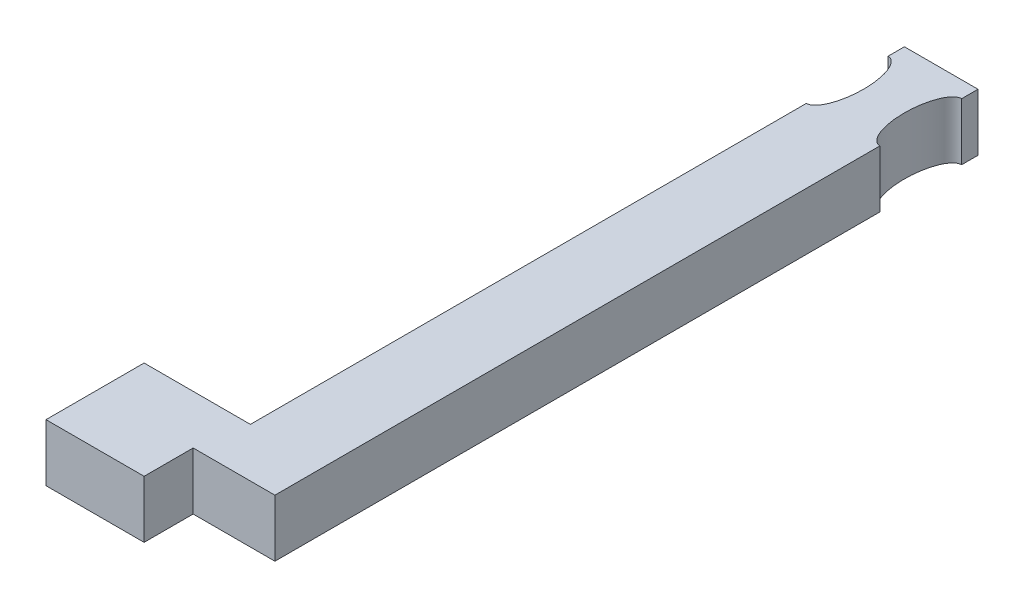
ISO-10303-21;
HEADER;
FILE_DESCRIPTION(('STEP AP214'),'2;1');
FILE_NAME('part.step','',(''),(''),'','','');
FILE_SCHEMA(('AUTOMOTIVE_DESIGN { 1 0 10303 214 1 1 1 1 }'));
ENDSEC;
DATA;
#1=APPLICATION_CONTEXT('core data for automotive mechanical design processes');
#2=APPLICATION_PROTOCOL_DEFINITION('international standard','automotive_design',2000,#1);
#3=PRODUCT_CONTEXT('',#1,'mechanical');
#4=PRODUCT('Part','Part','',(#3));
#5=PRODUCT_RELATED_PRODUCT_CATEGORY('part','',(#4));
#6=PRODUCT_DEFINITION_FORMATION('','',#4);
#7=PRODUCT_DEFINITION_CONTEXT('part definition',#1,'design');
#8=PRODUCT_DEFINITION('design','',#6,#7);
#9=PRODUCT_DEFINITION_SHAPE('','',#8);
#10=(LENGTH_UNIT() NAMED_UNIT(*) SI_UNIT(.MILLI.,.METRE.));
#11=(NAMED_UNIT(*) PLANE_ANGLE_UNIT() SI_UNIT($,.RADIAN.));
#12=(NAMED_UNIT(*) SI_UNIT($,.STERADIAN.) SOLID_ANGLE_UNIT());
#13=UNCERTAINTY_MEASURE_WITH_UNIT(LENGTH_MEASURE(1.E-05),#10,'distance_accuracy_value','');
#14=(GEOMETRIC_REPRESENTATION_CONTEXT(3) GLOBAL_UNCERTAINTY_ASSIGNED_CONTEXT((#13)) GLOBAL_UNIT_ASSIGNED_CONTEXT((#10,
#11,#12)) REPRESENTATION_CONTEXT('',''));
#15=CARTESIAN_POINT('',(0.,0.,0.));
#16=DIRECTION('',(0.,0.,1.));
#17=DIRECTION('',(1.,0.,0.));
#18=AXIS2_PLACEMENT_3D('',#15,#16,#17);
#19=CARTESIAN_POINT('',(6.5,3.5,-46.));
#20=DIRECTION('',(1.,0.,0.));
#21=DIRECTION('',(0.,0.,-1.));
#22=AXIS2_PLACEMENT_3D('',#19,#20,#21);
#23=PLANE('',#22);
#24=DIRECTION('',(0.,0.,1.));
#25=VECTOR('',#24,1.);
#26=CARTESIAN_POINT('',(6.5,0.,-46.));
#27=LINE('',#26,#25);
#28=CARTESIAN_POINT('',(6.5,0.,-46.));
#29=VERTEX_POINT('',#28);
#30=CARTESIAN_POINT('',(6.5,0.,-45.));
#31=VERTEX_POINT('',#30);
#32=EDGE_CURVE('E167',#29,#31,#27,.T.);
#33=ORIENTED_EDGE('',*,*,#32,.T.);
#34=DIRECTION('',(0.,-1.,0.));
#35=VECTOR('',#34,1.);
#36=CARTESIAN_POINT('',(6.5,3.5,-45.));
#37=LINE('',#36,#35);
#38=CARTESIAN_POINT('',(6.5,3.5,-45.));
#39=VERTEX_POINT('',#38);
#40=EDGE_CURVE('E11',#39,#31,#37,.T.);
#41=ORIENTED_EDGE('',*,*,#40,.F.);
#42=DIRECTION('',(0.,0.,1.));
#43=VECTOR('',#42,1.);
#44=CARTESIAN_POINT('',(6.5,3.5,-46.));
#45=LINE('',#44,#43);
#46=CARTESIAN_POINT('',(6.5,3.5,-46.));
#47=VERTEX_POINT('',#46);
#48=EDGE_CURVE('E191',#47,#39,#45,.T.);
#49=ORIENTED_EDGE('',*,*,#48,.F.);
#50=DIRECTION('',(0.,-1.,0.));
#51=VECTOR('',#50,1.);
#52=CARTESIAN_POINT('',(6.5,3.5,-46.));
#53=LINE('',#52,#51);
#54=EDGE_CURVE('E162',#47,#29,#53,.T.);
#55=ORIENTED_EDGE('',*,*,#54,.T.);
#56=EDGE_LOOP('',(#33,#41,#49,#55));
#57=FACE_BOUND('',#56,.T.);
#58=ADVANCED_FACE('F34',(#57),#23,.F.);
#59=CARTESIAN_POINT('',(6.5,3.5,-42.5));
#60=DIRECTION('',(0.,-1.,0.));
#61=DIRECTION('',(0.,0.,-1.));
#62=AXIS2_PLACEMENT_3D('',#59,#60,#61);
#63=ELLIPSE('',#62,2.5,1.);
#64=DIRECTION('',(0.,-1.,0.));
#65=VECTOR('',#64,1.);
#66=SURFACE_OF_LINEAR_EXTRUSION('',#63,#65);
#67=CARTESIAN_POINT('',(6.5,0.,-42.5));
#68=DIRECTION('',(0.,-1.,0.));
#69=DIRECTION('',(0.,0.,-1.));
#70=AXIS2_PLACEMENT_3D('',#67,#68,#69);
#71=ELLIPSE('',#70,2.5,1.);
#72=CARTESIAN_POINT('',(6.5,0.,-40.));
#73=VERTEX_POINT('',#72);
#74=EDGE_CURVE('E170',#31,#73,#71,.T.);
#75=ORIENTED_EDGE('',*,*,#74,.T.);
#76=DIRECTION('',(0.,-1.,0.));
#77=VECTOR('',#76,1.);
#78=CARTESIAN_POINT('',(6.5,3.5,-40.));
#79=LINE('',#78,#77);
#80=CARTESIAN_POINT('',(6.5,3.5,-40.));
#81=VERTEX_POINT('',#80);
#82=EDGE_CURVE('E41',#81,#73,#79,.T.);
#83=ORIENTED_EDGE('',*,*,#82,.F.);
#84=EDGE_CURVE('E110',#39,#81,#63,.T.);
#85=ORIENTED_EDGE('',*,*,#84,.F.);
#86=ORIENTED_EDGE('',*,*,#40,.T.);
#87=EDGE_LOOP('',(#75,#83,#85,#86));
#88=FACE_BOUND('',#87,.T.);
#89=ADVANCED_FACE('F265',(#88),#66,.F.);
#90=CARTESIAN_POINT('',(6.5,3.5,-40.));
#91=DIRECTION('',(1.,0.,0.));
#92=DIRECTION('',(0.,0.,-1.));
#93=AXIS2_PLACEMENT_3D('',#90,#91,#92);
#94=PLANE('',#93);
#95=DIRECTION('',(0.,0.,1.));
#96=VECTOR('',#95,1.);
#97=CARTESIAN_POINT('',(6.5,0.,-40.));
#98=LINE('',#97,#96);
#99=CARTESIAN_POINT('',(6.5,0.,-6.));
#100=VERTEX_POINT('',#99);
#101=EDGE_CURVE('E173',#73,#100,#98,.T.);
#102=ORIENTED_EDGE('',*,*,#101,.T.);
#103=DIRECTION('',(0.,-1.,0.));
#104=VECTOR('',#103,1.);
#105=CARTESIAN_POINT('',(6.5,3.5,-6.));
#106=LINE('',#105,#104);
#107=CARTESIAN_POINT('',(6.5,3.5,-6.));
#108=VERTEX_POINT('',#107);
#109=EDGE_CURVE('E210',#108,#100,#106,.T.);
#110=ORIENTED_EDGE('',*,*,#109,.F.);
#111=DIRECTION('',(0.,0.,1.));
#112=VECTOR('',#111,1.);
#113=CARTESIAN_POINT('',(6.5,3.5,-40.));
#114=LINE('',#113,#112);
#115=EDGE_CURVE('E218',#81,#108,#114,.T.);
#116=ORIENTED_EDGE('',*,*,#115,.F.);
#117=ORIENTED_EDGE('',*,*,#82,.T.);
#118=EDGE_LOOP('',(#102,#110,#116,#117));
#119=FACE_BOUND('',#118,.T.);
#120=ADVANCED_FACE('F216',(#119),#94,.F.);
#121=CARTESIAN_POINT('',(0.,3.5,-6.));
#122=DIRECTION('',(0.,0.,1.));
#123=DIRECTION('',(1.,0.,0.));
#124=AXIS2_PLACEMENT_3D('',#121,#122,#123);
#125=PLANE('',#124);
#126=DIRECTION('',(-1.,0.,0.));
#127=VECTOR('',#126,1.);
#128=CARTESIAN_POINT('',(0.,0.,-6.));
#129=LINE('',#128,#127);
#130=CARTESIAN_POINT('',(0.,0.,-6.));
#131=VERTEX_POINT('',#130);
#132=EDGE_CURVE('E175',#100,#131,#129,.T.);
#133=ORIENTED_EDGE('',*,*,#132,.T.);
#134=DIRECTION('',(0.,-1.,0.));
#135=VECTOR('',#134,1.);
#136=CARTESIAN_POINT('',(0.,3.5,-6.));
#137=LINE('',#136,#135);
#138=CARTESIAN_POINT('',(0.,3.5,-6.));
#139=VERTEX_POINT('',#138);
#140=EDGE_CURVE('E207',#139,#131,#137,.T.);
#141=ORIENTED_EDGE('',*,*,#140,.F.);
#142=DIRECTION('',(-1.,0.,0.));
#143=VECTOR('',#142,1.);
#144=CARTESIAN_POINT('',(0.,3.5,-6.));
#145=LINE('',#144,#143);
#146=EDGE_CURVE('E236',#108,#139,#145,.T.);
#147=ORIENTED_EDGE('',*,*,#146,.F.);
#148=ORIENTED_EDGE('',*,*,#109,.T.);
#149=EDGE_LOOP('',(#133,#141,#147,#148));
#150=FACE_BOUND('',#149,.T.);
#151=ADVANCED_FACE('F227',(#150),#125,.F.);
#152=CARTESIAN_POINT('',(0.,3.5,0.));
#153=DIRECTION('',(1.,0.,0.));
#154=DIRECTION('',(0.,0.,-1.));
#155=AXIS2_PLACEMENT_3D('',#152,#153,#154);
#156=PLANE('',#155);
#157=DIRECTION('',(0.,0.,1.));
#158=VECTOR('',#157,1.);
#159=CARTESIAN_POINT('',(0.,0.,0.));
#160=LINE('',#159,#158);
#161=CARTESIAN_POINT('',(0.,0.,0.));
#162=VERTEX_POINT('',#161);
#163=EDGE_CURVE('E177',#131,#162,#160,.T.);
#164=ORIENTED_EDGE('',*,*,#163,.T.);
#165=DIRECTION('',(0.,-1.,0.));
#166=VECTOR('',#165,1.);
#167=CARTESIAN_POINT('',(0.,3.5,0.));
#168=LINE('',#167,#166);
#169=CARTESIAN_POINT('',(0.,3.5,0.));
#170=VERTEX_POINT('',#169);
#171=EDGE_CURVE('E204',#170,#162,#168,.T.);
#172=ORIENTED_EDGE('',*,*,#171,.F.);
#173=DIRECTION('',(0.,0.,1.));
#174=VECTOR('',#173,1.);
#175=CARTESIAN_POINT('',(0.,3.5,0.));
#176=LINE('',#175,#174);
#177=EDGE_CURVE('E233',#139,#170,#176,.T.);
#178=ORIENTED_EDGE('',*,*,#177,.F.);
#179=ORIENTED_EDGE('',*,*,#140,.T.);
#180=EDGE_LOOP('',(#164,#172,#178,#179));
#181=FACE_BOUND('',#180,.T.);
#182=ADVANCED_FACE('F231',(#181),#156,.F.);
#183=CARTESIAN_POINT('',(0.,3.5,0.));
#184=DIRECTION('',(0.,0.,-1.));
#185=DIRECTION('',(-1.,0.,0.));
#186=AXIS2_PLACEMENT_3D('',#183,#184,#185);
#187=PLANE('',#186);
#188=DIRECTION('',(1.,0.,0.));
#189=VECTOR('',#188,1.);
#190=CARTESIAN_POINT('',(0.,0.,0.));
#191=LINE('',#190,#189);
#192=CARTESIAN_POINT('',(6.,0.,0.));
#193=VERTEX_POINT('',#192);
#194=EDGE_CURVE('E179',#162,#193,#191,.T.);
#195=ORIENTED_EDGE('',*,*,#194,.T.);
#196=DIRECTION('',(0.,-1.,0.));
#197=VECTOR('',#196,1.);
#198=CARTESIAN_POINT('',(6.,3.5,0.));
#199=LINE('',#198,#197);
#200=CARTESIAN_POINT('',(6.,3.5,0.));
#201=VERTEX_POINT('',#200);
#202=EDGE_CURVE('E201',#201,#193,#199,.T.);
#203=ORIENTED_EDGE('',*,*,#202,.F.);
#204=DIRECTION('',(1.,0.,0.));
#205=VECTOR('',#204,1.);
#206=CARTESIAN_POINT('',(0.,3.5,0.));
#207=LINE('',#206,#205);
#208=EDGE_CURVE('E235',#170,#201,#207,.T.);
#209=ORIENTED_EDGE('',*,*,#208,.F.);
#210=ORIENTED_EDGE('',*,*,#171,.T.);
#211=EDGE_LOOP('',(#195,#203,#209,#210));
#212=FACE_BOUND('',#211,.T.);
#213=ADVANCED_FACE('F274',(#212),#187,.F.);
#214=CARTESIAN_POINT('',(6.,3.5,0.));
#215=DIRECTION('',(-1.,0.,0.));
#216=DIRECTION('',(0.,0.,1.));
#217=AXIS2_PLACEMENT_3D('',#214,#215,#216);
#218=PLANE('',#217);
#219=DIRECTION('',(0.,0.,-1.));
#220=VECTOR('',#219,1.);
#221=CARTESIAN_POINT('',(6.,0.,0.));
#222=LINE('',#221,#220);
#223=CARTESIAN_POINT('',(6.,0.,-3.));
#224=VERTEX_POINT('',#223);
#225=EDGE_CURVE('E181',#193,#224,#222,.T.);
#226=ORIENTED_EDGE('',*,*,#225,.T.);
#227=DIRECTION('',(0.,-1.,0.));
#228=VECTOR('',#227,1.);
#229=CARTESIAN_POINT('',(6.,3.5,-3.));
#230=LINE('',#229,#228);
#231=CARTESIAN_POINT('',(6.,3.5,-3.));
#232=VERTEX_POINT('',#231);
#233=EDGE_CURVE('E198',#232,#224,#230,.T.);
#234=ORIENTED_EDGE('',*,*,#233,.F.);
#235=DIRECTION('',(0.,0.,-1.));
#236=VECTOR('',#235,1.);
#237=CARTESIAN_POINT('',(6.,3.5,0.));
#238=LINE('',#237,#236);
#239=EDGE_CURVE('E238',#201,#232,#238,.T.);
#240=ORIENTED_EDGE('',*,*,#239,.F.);
#241=ORIENTED_EDGE('',*,*,#202,.T.);
#242=EDGE_LOOP('',(#226,#234,#240,#241));
#243=FACE_BOUND('',#242,.T.);
#244=ADVANCED_FACE('F277',(#243),#218,.F.);
#245=CARTESIAN_POINT('',(6.,3.5,-3.));
#246=DIRECTION('',(0.,0.,-1.));
#247=DIRECTION('',(-1.,0.,0.));
#248=AXIS2_PLACEMENT_3D('',#245,#246,#247);
#249=PLANE('',#248);
#250=DIRECTION('',(1.,0.,0.));
#251=VECTOR('',#250,1.);
#252=CARTESIAN_POINT('',(6.,0.,-3.));
#253=LINE('',#252,#251);
#254=CARTESIAN_POINT('',(11.,0.,-3.));
#255=VERTEX_POINT('',#254);
#256=EDGE_CURVE('E183',#224,#255,#253,.T.);
#257=ORIENTED_EDGE('',*,*,#256,.T.);
#258=DIRECTION('',(0.,-1.,0.));
#259=VECTOR('',#258,1.);
#260=CARTESIAN_POINT('',(11.,3.5,-3.));
#261=LINE('',#260,#259);
#262=CARTESIAN_POINT('',(11.,3.5,-3.));
#263=VERTEX_POINT('',#262);
#264=EDGE_CURVE('E195',#263,#255,#261,.T.);
#265=ORIENTED_EDGE('',*,*,#264,.F.);
#266=DIRECTION('',(1.,0.,0.));
#267=VECTOR('',#266,1.);
#268=CARTESIAN_POINT('',(6.,3.5,-3.));
#269=LINE('',#268,#267);
#270=EDGE_CURVE('E244',#232,#263,#269,.T.);
#271=ORIENTED_EDGE('',*,*,#270,.F.);
#272=ORIENTED_EDGE('',*,*,#233,.T.);
#273=EDGE_LOOP('',(#257,#265,#271,#272));
#274=FACE_BOUND('',#273,.T.);
#275=ADVANCED_FACE('F250',(#274),#249,.F.);
#276=CARTESIAN_POINT('',(11.,3.5,-40.));
#277=DIRECTION('',(-1.,0.,0.));
#278=DIRECTION('',(0.,0.,1.));
#279=AXIS2_PLACEMENT_3D('',#276,#277,#278);
#280=PLANE('',#279);
#281=DIRECTION('',(0.,0.,-1.));
#282=VECTOR('',#281,1.);
#283=CARTESIAN_POINT('',(11.,0.,-40.));
#284=LINE('',#283,#282);
#285=CARTESIAN_POINT('',(11.,0.,-40.));
#286=VERTEX_POINT('',#285);
#287=EDGE_CURVE('E185',#255,#286,#284,.T.);
#288=ORIENTED_EDGE('',*,*,#287,.T.);
#289=DIRECTION('',(0.,-1.,0.));
#290=VECTOR('',#289,1.);
#291=CARTESIAN_POINT('',(11.,3.5,-40.));
#292=LINE('',#291,#290);
#293=CARTESIAN_POINT('',(11.,3.5,-40.));
#294=VERTEX_POINT('',#293);
#295=EDGE_CURVE('E157',#294,#286,#292,.T.);
#296=ORIENTED_EDGE('',*,*,#295,.F.);
#297=DIRECTION('',(0.,0.,-1.));
#298=VECTOR('',#297,1.);
#299=CARTESIAN_POINT('',(11.,3.5,-40.));
#300=LINE('',#299,#298);
#301=EDGE_CURVE('E145',#263,#294,#300,.T.);
#302=ORIENTED_EDGE('',*,*,#301,.F.);
#303=ORIENTED_EDGE('',*,*,#264,.T.);
#304=EDGE_LOOP('',(#288,#296,#302,#303));
#305=FACE_BOUND('',#304,.T.);
#306=ADVANCED_FACE('F254',(#305),#280,.F.);
#307=CARTESIAN_POINT('',(11.,3.5,-42.5));
#308=DIRECTION('',(0.,-1.,0.));
#309=DIRECTION('',(0.,0.,-1.));
#310=AXIS2_PLACEMENT_3D('',#307,#308,#309);
#311=ELLIPSE('',#310,2.5,1.);
#312=DIRECTION('',(0.,-1.,0.));
#313=VECTOR('',#312,1.);
#314=SURFACE_OF_LINEAR_EXTRUSION('',#311,#313);
#315=CARTESIAN_POINT('',(11.,0.,-42.5));
#316=DIRECTION('',(0.,-1.,0.));
#317=DIRECTION('',(0.,0.,-1.));
#318=AXIS2_PLACEMENT_3D('',#315,#316,#317);
#319=ELLIPSE('',#318,2.5,1.);
#320=CARTESIAN_POINT('',(11.,0.,-45.));
#321=VERTEX_POINT('',#320);
#322=EDGE_CURVE('E154',#286,#321,#319,.T.);
#323=ORIENTED_EDGE('',*,*,#322,.T.);
#324=DIRECTION('',(0.,-1.,0.));
#325=VECTOR('',#324,1.);
#326=CARTESIAN_POINT('',(11.,3.5,-45.));
#327=LINE('',#326,#325);
#328=CARTESIAN_POINT('',(11.,3.5,-45.));
#329=VERTEX_POINT('',#328);
#330=EDGE_CURVE('E151',#329,#321,#327,.T.);
#331=ORIENTED_EDGE('',*,*,#330,.F.);
#332=EDGE_CURVE('E138',#294,#329,#311,.T.);
#333=ORIENTED_EDGE('',*,*,#332,.F.);
#334=ORIENTED_EDGE('',*,*,#295,.T.);
#335=EDGE_LOOP('',(#323,#331,#333,#334));
#336=FACE_BOUND('',#335,.T.);
#337=ADVANCED_FACE('F152',(#336),#314,.F.);
#338=CARTESIAN_POINT('',(11.,3.5,-46.));
#339=DIRECTION('',(-1.,0.,0.));
#340=DIRECTION('',(0.,0.,1.));
#341=AXIS2_PLACEMENT_3D('',#338,#339,#340);
#342=PLANE('',#341);
#343=DIRECTION('',(0.,0.,-1.));
#344=VECTOR('',#343,1.);
#345=CARTESIAN_POINT('',(11.,0.,-46.));
#346=LINE('',#345,#344);
#347=CARTESIAN_POINT('',(11.,0.,-46.));
#348=VERTEX_POINT('',#347);
#349=EDGE_CURVE('E188',#321,#348,#346,.T.);
#350=ORIENTED_EDGE('',*,*,#349,.T.);
#351=DIRECTION('',(0.,-1.,0.));
#352=VECTOR('',#351,1.);
#353=CARTESIAN_POINT('',(11.,3.5,-46.));
#354=LINE('',#353,#352);
#355=CARTESIAN_POINT('',(11.,3.5,-46.));
#356=VERTEX_POINT('',#355);
#357=EDGE_CURVE('E158',#356,#348,#354,.T.);
#358=ORIENTED_EDGE('',*,*,#357,.F.);
#359=DIRECTION('',(0.,0.,-1.));
#360=VECTOR('',#359,1.);
#361=CARTESIAN_POINT('',(11.,3.5,-46.));
#362=LINE('',#361,#360);
#363=EDGE_CURVE('E142',#329,#356,#362,.T.);
#364=ORIENTED_EDGE('',*,*,#363,.F.);
#365=ORIENTED_EDGE('',*,*,#330,.T.);
#366=EDGE_LOOP('',(#350,#358,#364,#365));
#367=FACE_BOUND('',#366,.T.);
#368=ADVANCED_FACE('F160',(#367),#342,.F.);
#369=CARTESIAN_POINT('',(6.5,3.5,-46.));
#370=DIRECTION('',(0.,0.,1.));
#371=DIRECTION('',(1.,0.,0.));
#372=AXIS2_PLACEMENT_3D('',#369,#370,#371);
#373=PLANE('',#372);
#374=DIRECTION('',(-1.,0.,0.));
#375=VECTOR('',#374,1.);
#376=CARTESIAN_POINT('',(6.5,0.,-46.));
#377=LINE('',#376,#375);
#378=EDGE_CURVE('E102',#348,#29,#377,.T.);
#379=ORIENTED_EDGE('',*,*,#378,.T.);
#380=ORIENTED_EDGE('',*,*,#54,.F.);
#381=DIRECTION('',(-1.,0.,0.));
#382=VECTOR('',#381,1.);
#383=CARTESIAN_POINT('',(6.5,3.5,-46.));
#384=LINE('',#383,#382);
#385=EDGE_CURVE('E57',#356,#47,#384,.T.);
#386=ORIENTED_EDGE('',*,*,#385,.F.);
#387=ORIENTED_EDGE('',*,*,#357,.T.);
#388=EDGE_LOOP('',(#379,#380,#386,#387));
#389=FACE_BOUND('',#388,.T.);
#390=ADVANCED_FACE('F255',(#389),#373,.F.);
#391=CARTESIAN_POINT('',(6.5,3.5,-42.5));
#392=DIRECTION('',(0.,-1.,0.));
#393=DIRECTION('',(0.,0.,-1.));
#394=AXIS2_PLACEMENT_3D('',#391,#392,#393);
#395=PLANE('',#394);
#396=ORIENTED_EDGE('',*,*,#48,.T.);
#397=ORIENTED_EDGE('',*,*,#84,.T.);
#398=ORIENTED_EDGE('',*,*,#115,.T.);
#399=ORIENTED_EDGE('',*,*,#146,.T.);
#400=ORIENTED_EDGE('',*,*,#177,.T.);
#401=ORIENTED_EDGE('',*,*,#208,.T.);
#402=ORIENTED_EDGE('',*,*,#239,.T.);
#403=ORIENTED_EDGE('',*,*,#270,.T.);
#404=ORIENTED_EDGE('',*,*,#301,.T.);
#405=ORIENTED_EDGE('',*,*,#332,.T.);
#406=ORIENTED_EDGE('',*,*,#363,.T.);
#407=ORIENTED_EDGE('',*,*,#385,.T.);
#408=EDGE_LOOP('',(#396,#397,#398,#399,#400,#401,#402,#403,#404,#405,#406,#407));
#409=FACE_BOUND('',#408,.T.);
#410=ADVANCED_FACE('F140',(#409),#395,.F.);
#411=CARTESIAN_POINT('',(6.5,0.,-42.5));
#412=DIRECTION('',(0.,-1.,0.));
#413=DIRECTION('',(0.,0.,-1.));
#414=AXIS2_PLACEMENT_3D('',#411,#412,#413);
#415=PLANE('',#414);
#416=DIRECTION('',(0.,0.,1.));
#417=VECTOR('',#416,1.);
#418=CARTESIAN_POINT('',(4.7,0.,-1.3));
#419=LINE('',#418,#417);
#420=CARTESIAN_POINT('',(4.7,0.,-4.7));
#421=VERTEX_POINT('',#420);
#422=CARTESIAN_POINT('',(4.7,0.,-1.3));
#423=VERTEX_POINT('',#422);
#424=EDGE_CURVE('E48',#421,#423,#419,.T.);
#425=ORIENTED_EDGE('',*,*,#424,.F.);
#426=DIRECTION('',(1.,0.,0.));
#427=VECTOR('',#426,1.);
#428=CARTESIAN_POINT('',(1.3,0.,-4.7));
#429=LINE('',#428,#427);
#430=CARTESIAN_POINT('',(1.3,0.,-4.7));
#431=VERTEX_POINT('',#430);
#432=EDGE_CURVE('E443',#431,#421,#429,.T.);
#433=ORIENTED_EDGE('',*,*,#432,.F.);
#434=DIRECTION('',(0.,0.,-1.));
#435=VECTOR('',#434,1.);
#436=CARTESIAN_POINT('',(1.3,0.,-1.3));
#437=LINE('',#436,#435);
#438=CARTESIAN_POINT('',(1.3,0.,-1.3));
#439=VERTEX_POINT('',#438);
#440=EDGE_CURVE('E448',#439,#431,#437,.T.);
#441=ORIENTED_EDGE('',*,*,#440,.F.);
#442=DIRECTION('',(-1.,0.,0.));
#443=VECTOR('',#442,1.);
#444=CARTESIAN_POINT('',(1.3,0.,-1.3));
#445=LINE('',#444,#443);
#446=EDGE_CURVE('E454',#423,#439,#445,.T.);
#447=ORIENTED_EDGE('',*,*,#446,.F.);
#448=EDGE_LOOP('',(#425,#433,#441,#447));
#449=FACE_BOUND('',#448,.T.);
#450=ORIENTED_EDGE('',*,*,#32,.F.);
#451=ORIENTED_EDGE('',*,*,#378,.F.);
#452=ORIENTED_EDGE('',*,*,#349,.F.);
#453=ORIENTED_EDGE('',*,*,#322,.F.);
#454=ORIENTED_EDGE('',*,*,#287,.F.);
#455=ORIENTED_EDGE('',*,*,#256,.F.);
#456=ORIENTED_EDGE('',*,*,#225,.F.);
#457=ORIENTED_EDGE('',*,*,#194,.F.);
#458=ORIENTED_EDGE('',*,*,#163,.F.);
#459=ORIENTED_EDGE('',*,*,#132,.F.);
#460=ORIENTED_EDGE('',*,*,#101,.F.);
#461=ORIENTED_EDGE('',*,*,#74,.F.);
#462=EDGE_LOOP('',(#450,#451,#452,#453,#454,#455,#456,#457,#458,#459,#460,#461));
#463=FACE_BOUND('',#462,.T.);
#464=ADVANCED_FACE('F222',(#449,#463),#415,.T.);
#465=CARTESIAN_POINT('',(4.7,2.5,-1.3));
#466=DIRECTION('',(1.,0.,0.));
#467=DIRECTION('',(0.,0.,-1.));
#468=AXIS2_PLACEMENT_3D('',#465,#466,#467);
#469=PLANE('',#468);
#470=ORIENTED_EDGE('',*,*,#424,.T.);
#471=DIRECTION('',(0.,-1.,0.));
#472=VECTOR('',#471,1.);
#473=CARTESIAN_POINT('',(4.7,2.5,-1.3));
#474=LINE('',#473,#472);
#475=CARTESIAN_POINT('',(4.7,2.5,-1.3));
#476=VERTEX_POINT('',#475);
#477=EDGE_CURVE('E262',#476,#423,#474,.T.);
#478=ORIENTED_EDGE('',*,*,#477,.F.);
#479=DIRECTION('',(0.,0.,1.));
#480=VECTOR('',#479,1.);
#481=CARTESIAN_POINT('',(4.7,2.5,-1.3));
#482=LINE('',#481,#480);
#483=CARTESIAN_POINT('',(4.7,2.5,-4.7));
#484=VERTEX_POINT('',#483);
#485=EDGE_CURVE('E435',#484,#476,#482,.T.);
#486=ORIENTED_EDGE('',*,*,#485,.F.);
#487=DIRECTION('',(0.,-1.,0.));
#488=VECTOR('',#487,1.);
#489=CARTESIAN_POINT('',(4.7,2.5,-4.7));
#490=LINE('',#489,#488);
#491=EDGE_CURVE('E171',#484,#421,#490,.T.);
#492=ORIENTED_EDGE('',*,*,#491,.T.);
#493=EDGE_LOOP('',(#470,#478,#486,#492));
#494=FACE_BOUND('',#493,.T.);
#495=ADVANCED_FACE('F294',(#494),#469,.F.);
#496=CARTESIAN_POINT('',(1.3,2.5,-4.7));
#497=DIRECTION('',(0.,0.,-1.));
#498=DIRECTION('',(-1.,0.,0.));
#499=AXIS2_PLACEMENT_3D('',#496,#497,#498);
#500=PLANE('',#499);
#501=ORIENTED_EDGE('',*,*,#432,.T.);
#502=ORIENTED_EDGE('',*,*,#491,.F.);
#503=DIRECTION('',(1.,0.,0.));
#504=VECTOR('',#503,1.);
#505=CARTESIAN_POINT('',(1.3,2.5,-4.7));
#506=LINE('',#505,#504);
#507=CARTESIAN_POINT('',(1.3,2.5,-4.7));
#508=VERTEX_POINT('',#507);
#509=EDGE_CURVE('E441',#508,#484,#506,.T.);
#510=ORIENTED_EDGE('',*,*,#509,.F.);
#511=DIRECTION('',(0.,-1.,0.));
#512=VECTOR('',#511,1.);
#513=CARTESIAN_POINT('',(1.3,2.5,-4.7));
#514=LINE('',#513,#512);
#515=EDGE_CURVE('E460',#508,#431,#514,.T.);
#516=ORIENTED_EDGE('',*,*,#515,.T.);
#517=EDGE_LOOP('',(#501,#502,#510,#516));
#518=FACE_BOUND('',#517,.T.);
#519=ADVANCED_FACE('F300',(#518),#500,.F.);
#520=CARTESIAN_POINT('',(1.3,2.5,-1.3));
#521=DIRECTION('',(-1.,0.,0.));
#522=DIRECTION('',(0.,0.,1.));
#523=AXIS2_PLACEMENT_3D('',#520,#521,#522);
#524=PLANE('',#523);
#525=ORIENTED_EDGE('',*,*,#440,.T.);
#526=ORIENTED_EDGE('',*,*,#515,.F.);
#527=DIRECTION('',(0.,0.,-1.));
#528=VECTOR('',#527,1.);
#529=CARTESIAN_POINT('',(1.3,2.5,-1.3));
#530=LINE('',#529,#528);
#531=CARTESIAN_POINT('',(1.3,2.5,-1.3));
#532=VERTEX_POINT('',#531);
#533=EDGE_CURVE('E445',#532,#508,#530,.T.);
#534=ORIENTED_EDGE('',*,*,#533,.F.);
#535=DIRECTION('',(0.,-1.,0.));
#536=VECTOR('',#535,1.);
#537=CARTESIAN_POINT('',(1.3,2.5,-1.3));
#538=LINE('',#537,#536);
#539=EDGE_CURVE('E462',#532,#439,#538,.T.);
#540=ORIENTED_EDGE('',*,*,#539,.T.);
#541=EDGE_LOOP('',(#525,#526,#534,#540));
#542=FACE_BOUND('',#541,.T.);
#543=ADVANCED_FACE('F305',(#542),#524,.F.);
#544=CARTESIAN_POINT('',(1.3,2.5,-1.3));
#545=DIRECTION('',(0.,0.,1.));
#546=DIRECTION('',(1.,0.,0.));
#547=AXIS2_PLACEMENT_3D('',#544,#545,#546);
#548=PLANE('',#547);
#549=ORIENTED_EDGE('',*,*,#446,.T.);
#550=ORIENTED_EDGE('',*,*,#539,.F.);
#551=DIRECTION('',(-1.,0.,0.));
#552=VECTOR('',#551,1.);
#553=CARTESIAN_POINT('',(1.3,2.5,-1.3));
#554=LINE('',#553,#552);
#555=EDGE_CURVE('E439',#476,#532,#554,.T.);
#556=ORIENTED_EDGE('',*,*,#555,.F.);
#557=ORIENTED_EDGE('',*,*,#477,.T.);
#558=EDGE_LOOP('',(#549,#550,#556,#557));
#559=FACE_BOUND('',#558,.T.);
#560=ADVANCED_FACE('F301',(#559),#548,.F.);
#561=CARTESIAN_POINT('',(0.,2.5,0.));
#562=DIRECTION('',(0.,-1.,0.));
#563=DIRECTION('',(0.,0.,-1.));
#564=AXIS2_PLACEMENT_3D('',#561,#562,#563);
#565=PLANE('',#564);
#566=ORIENTED_EDGE('',*,*,#485,.T.);
#567=ORIENTED_EDGE('',*,*,#555,.T.);
#568=ORIENTED_EDGE('',*,*,#533,.T.);
#569=ORIENTED_EDGE('',*,*,#509,.T.);
#570=EDGE_LOOP('',(#566,#567,#568,#569));
#571=FACE_BOUND('',#570,.T.);
#572=ADVANCED_FACE('F304',(#571),#565,.T.);
#573=CLOSED_SHELL('',(#58,#89,#120,#151,#182,#213,#244,#275,#306,#337,#368,#390,#410,#464,#495,
#519,#543,#560,#572));
#574=MANIFOLD_SOLID_BREP('B2',#573);
#575=ADVANCED_BREP_SHAPE_REPRESENTATION('',(#18,#574),#14);
#576=SHAPE_DEFINITION_REPRESENTATION(#9,#575);
ENDSEC;
END-ISO-10303-21;
